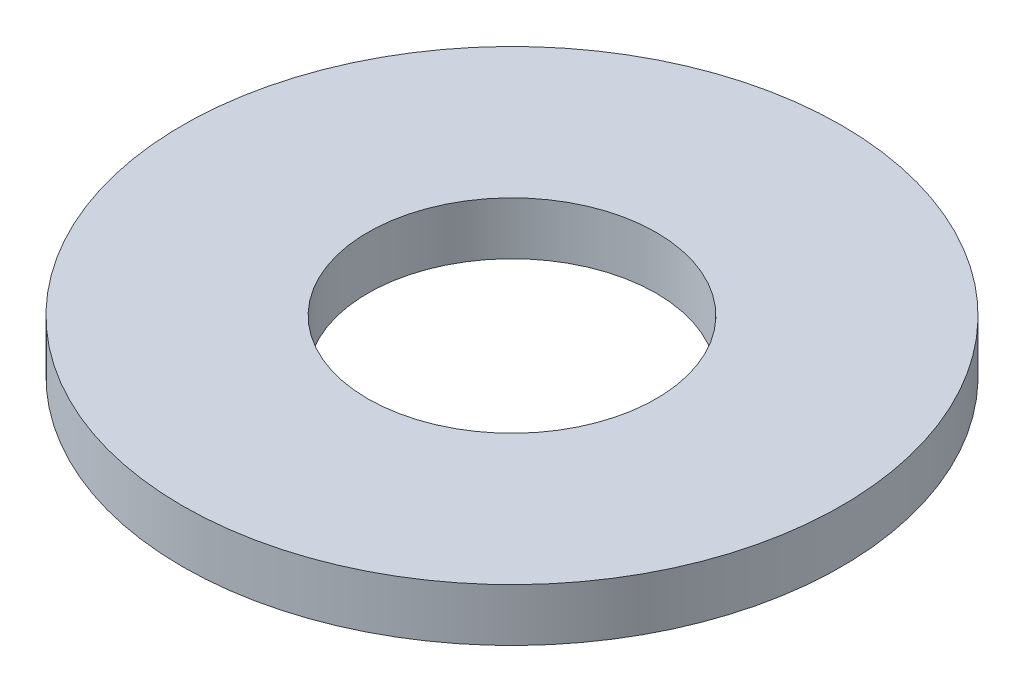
ISO-10303-21;
HEADER;
FILE_DESCRIPTION(('STEP AP214'),'2;1');
FILE_NAME('part.step','',(''),(''),'','','');
FILE_SCHEMA(('AUTOMOTIVE_DESIGN { 1 0 10303 214 1 1 1 1 }'));
ENDSEC;
DATA;
#1=APPLICATION_CONTEXT('core data for automotive mechanical design processes');
#2=APPLICATION_PROTOCOL_DEFINITION('international standard','automotive_design',2000,#1);
#3=PRODUCT_CONTEXT('',#1,'mechanical');
#4=PRODUCT('Part','Part','',(#3));
#5=PRODUCT_RELATED_PRODUCT_CATEGORY('part','',(#4));
#6=PRODUCT_DEFINITION_FORMATION('','',#4);
#7=PRODUCT_DEFINITION_CONTEXT('part definition',#1,'design');
#8=PRODUCT_DEFINITION('design','',#6,#7);
#9=PRODUCT_DEFINITION_SHAPE('','',#8);
#10=(LENGTH_UNIT() NAMED_UNIT(*) SI_UNIT(.MILLI.,.METRE.));
#11=(NAMED_UNIT(*) PLANE_ANGLE_UNIT() SI_UNIT($,.RADIAN.));
#12=(NAMED_UNIT(*) SI_UNIT($,.STERADIAN.) SOLID_ANGLE_UNIT());
#13=UNCERTAINTY_MEASURE_WITH_UNIT(LENGTH_MEASURE(1.E-05),#10,'distance_accuracy_value','');
#14=(GEOMETRIC_REPRESENTATION_CONTEXT(3) GLOBAL_UNCERTAINTY_ASSIGNED_CONTEXT((#13)) GLOBAL_UNIT_ASSIGNED_CONTEXT((#10,
#11,#12)) REPRESENTATION_CONTEXT('',''));
#15=CARTESIAN_POINT('',(0.,0.,0.));
#16=DIRECTION('',(0.,0.,1.));
#17=DIRECTION('',(1.,0.,0.));
#18=AXIS2_PLACEMENT_3D('',#15,#16,#17);
#19=CARTESIAN_POINT('',(0.,0.508,0.));
#20=DIRECTION('',(0.,-1.,0.));
#21=DIRECTION('',(0.,0.,-1.));
#22=AXIS2_PLACEMENT_3D('',#19,#20,#21);
#23=CYLINDRICAL_SURFACE('',#22,3.175);
#24=CARTESIAN_POINT('',(0.,0.508,0.));
#25=DIRECTION('',(0.,1.,0.));
#26=DIRECTION('',(0.,0.,1.));
#27=AXIS2_PLACEMENT_3D('',#24,#25,#26);
#28=CIRCLE('',#27,3.175);
#29=CARTESIAN_POINT('',(0.,0.508000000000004,3.175));
#30=VERTEX_POINT('',#29);
#31=EDGE_CURVE('E10',#30,#30,#28,.T.);
#32=ORIENTED_EDGE('',*,*,#31,.F.);
#33=EDGE_LOOP('',(#32));
#34=FACE_BOUND('',#33,.T.);
#35=CARTESIAN_POINT('',(0.,0.,0.));
#36=DIRECTION('',(0.,1.,0.));
#37=DIRECTION('',(0.,0.,1.));
#38=AXIS2_PLACEMENT_3D('',#35,#36,#37);
#39=CIRCLE('',#38,3.175);
#40=CARTESIAN_POINT('',(0.,0.,3.175));
#41=VERTEX_POINT('',#40);
#42=EDGE_CURVE('E37',#41,#41,#39,.T.);
#43=ORIENTED_EDGE('',*,*,#42,.T.);
#44=EDGE_LOOP('',(#43));
#45=FACE_BOUND('',#44,.T.);
#46=ADVANCED_FACE('F34',(#34,#45),#23,.T.);
#47=CARTESIAN_POINT('',(0.,0.508,0.));
#48=DIRECTION('',(0.,1.,0.));
#49=DIRECTION('',(0.,0.,1.));
#50=AXIS2_PLACEMENT_3D('',#47,#48,#49);
#51=PLANE('',#50);
#52=CARTESIAN_POINT('',(0.,0.508,0.));
#53=DIRECTION('',(0.,1.,0.));
#54=DIRECTION('',(0.,0.,1.));
#55=AXIS2_PLACEMENT_3D('',#52,#53,#54);
#56=CIRCLE('',#55,1.3890625);
#57=CARTESIAN_POINT('',(0.,0.508000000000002,1.3890625));
#58=VERTEX_POINT('',#57);
#59=EDGE_CURVE('E48',#58,#58,#56,.T.);
#60=ORIENTED_EDGE('',*,*,#59,.F.);
#61=EDGE_LOOP('',(#60));
#62=FACE_BOUND('',#61,.T.);
#63=ORIENTED_EDGE('',*,*,#31,.T.);
#64=EDGE_LOOP('',(#63));
#65=FACE_BOUND('',#64,.T.);
#66=ADVANCED_FACE('F55',(#62,#65),#51,.T.);
#67=CARTESIAN_POINT('',(0.,0.,0.));
#68=DIRECTION('',(0.,1.,0.));
#69=DIRECTION('',(0.,0.,1.));
#70=AXIS2_PLACEMENT_3D('',#67,#68,#69);
#71=PLANE('',#70);
#72=CARTESIAN_POINT('',(0.,0.,0.));
#73=DIRECTION('',(0.,1.,0.));
#74=DIRECTION('',(0.,0.,1.));
#75=AXIS2_PLACEMENT_3D('',#72,#73,#74);
#76=CIRCLE('',#75,1.3890625);
#77=CARTESIAN_POINT('',(0.,0.,1.3890625));
#78=VERTEX_POINT('',#77);
#79=EDGE_CURVE('E44',#78,#78,#76,.F.);
#80=ORIENTED_EDGE('',*,*,#79,.F.);
#81=EDGE_LOOP('',(#80));
#82=FACE_BOUND('',#81,.T.);
#83=ORIENTED_EDGE('',*,*,#42,.F.);
#84=EDGE_LOOP('',(#83));
#85=FACE_BOUND('',#84,.T.);
#86=ADVANCED_FACE('F57',(#82,#85),#71,.F.);
#87=CARTESIAN_POINT('',(0.,-0.00100000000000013,0.));
#88=DIRECTION('',(0.,1.,0.));
#89=DIRECTION('',(0.,0.,1.));
#90=AXIS2_PLACEMENT_3D('',#87,#88,#89);
#91=CYLINDRICAL_SURFACE('',#90,1.3890625);
#92=ORIENTED_EDGE('',*,*,#59,.T.);
#93=EDGE_LOOP('',(#92));
#94=FACE_BOUND('',#93,.T.);
#95=ORIENTED_EDGE('',*,*,#79,.T.);
#96=EDGE_LOOP('',(#95));
#97=FACE_BOUND('',#96,.T.);
#98=ADVANCED_FACE('F52',(#94,#97),#91,.F.);
#99=CLOSED_SHELL('',(#46,#66,#86,#98));
#100=MANIFOLD_SOLID_BREP('B2',#99);
#101=ADVANCED_BREP_SHAPE_REPRESENTATION('',(#18,#100),#14);
#102=SHAPE_DEFINITION_REPRESENTATION(#9,#101);
ENDSEC;
END-ISO-10303-21;
